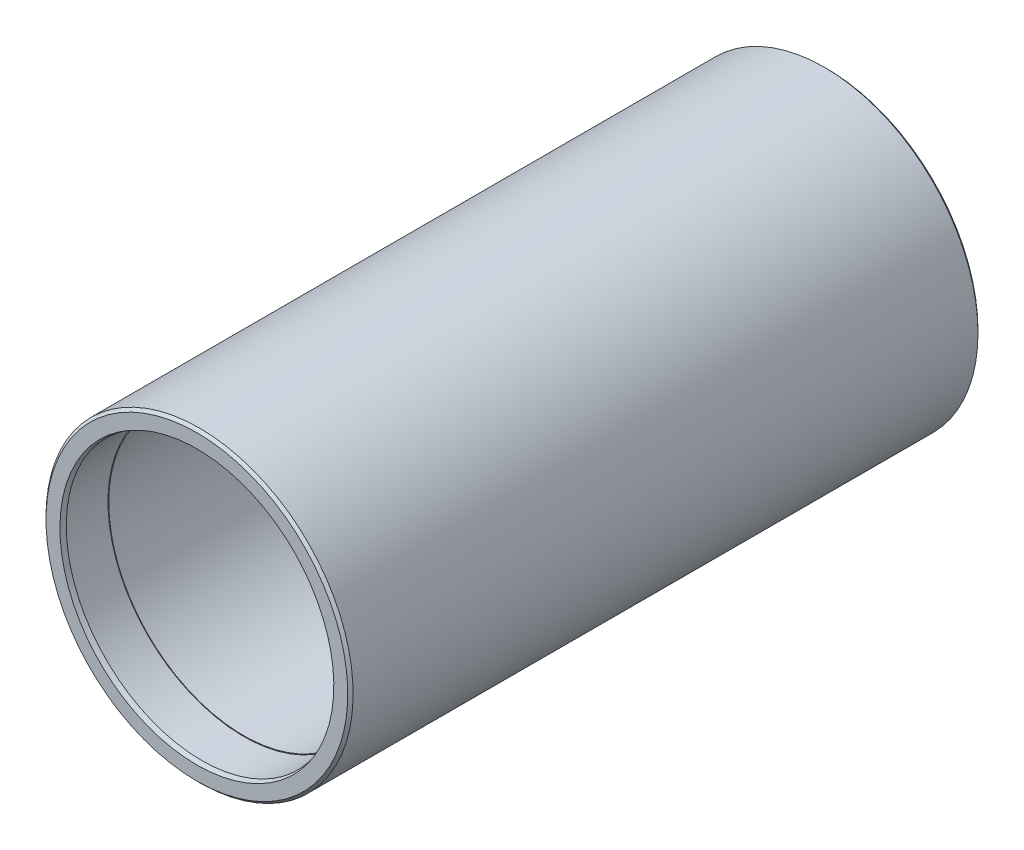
ISO-10303-21;
HEADER;
FILE_DESCRIPTION(('STEP AP214'),'2;1');
FILE_NAME('part.step','',(''),(''),'','','');
FILE_SCHEMA(('AUTOMOTIVE_DESIGN { 1 0 10303 214 1 1 1 1 }'));
ENDSEC;
DATA;
#1=APPLICATION_CONTEXT('core data for automotive mechanical design processes');
#2=APPLICATION_PROTOCOL_DEFINITION('international standard','automotive_design',2000,#1);
#3=PRODUCT_CONTEXT('',#1,'mechanical');
#4=PRODUCT('Part','Part','',(#3));
#5=PRODUCT_RELATED_PRODUCT_CATEGORY('part','',(#4));
#6=PRODUCT_DEFINITION_FORMATION('','',#4);
#7=PRODUCT_DEFINITION_CONTEXT('part definition',#1,'design');
#8=PRODUCT_DEFINITION('design','',#6,#7);
#9=PRODUCT_DEFINITION_SHAPE('','',#8);
#10=(LENGTH_UNIT() NAMED_UNIT(*) SI_UNIT(.MILLI.,.METRE.));
#11=(NAMED_UNIT(*) PLANE_ANGLE_UNIT() SI_UNIT($,.RADIAN.));
#12=(NAMED_UNIT(*) SI_UNIT($,.STERADIAN.) SOLID_ANGLE_UNIT());
#13=UNCERTAINTY_MEASURE_WITH_UNIT(LENGTH_MEASURE(1.E-05),#10,'distance_accuracy_value','');
#14=(GEOMETRIC_REPRESENTATION_CONTEXT(3) GLOBAL_UNCERTAINTY_ASSIGNED_CONTEXT((#13)) GLOBAL_UNIT_ASSIGNED_CONTEXT((#10,
#11,#12)) REPRESENTATION_CONTEXT('',''));
#15=CARTESIAN_POINT('',(0.,0.,0.));
#16=DIRECTION('',(0.,0.,1.));
#17=DIRECTION('',(1.,0.,0.));
#18=AXIS2_PLACEMENT_3D('',#15,#16,#17);
#19=CARTESIAN_POINT('',(0.,0.,3.732050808));
#20=DIRECTION('',(0.,0.,-1.));
#21=DIRECTION('',(0.,1.,0.));
#22=AXIS2_PLACEMENT_3D('',#19,#20,#21);
#23=CONICAL_SURFACE('',#22,101.5,0.26179938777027);
#24=CARTESIAN_POINT('',(0.,0.,0.));
#25=DIRECTION('',(0.,0.,-1.));
#26=DIRECTION('',(0.,1.,0.));
#27=AXIS2_PLACEMENT_3D('',#24,#25,#26);
#28=CIRCLE('',#27,102.5);
#29=CARTESIAN_POINT('',(0.,102.5,0.));
#30=VERTEX_POINT('',#29);
#31=EDGE_CURVE('E18',#30,#30,#28,.T.);
#32=ORIENTED_EDGE('',*,*,#31,.T.);
#33=EDGE_LOOP('',(#32));
#34=FACE_BOUND('',#33,.T.);
#35=CARTESIAN_POINT('',(0.,0.,3.732050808));
#36=DIRECTION('',(0.,0.,-1.));
#37=DIRECTION('',(-1.,0.,0.));
#38=AXIS2_PLACEMENT_3D('',#35,#36,#37);
#39=CIRCLE('',#38,101.5);
#40=CARTESIAN_POINT('',(-101.5,0.,3.732050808));
#41=VERTEX_POINT('',#40);
#42=EDGE_CURVE('E31',#41,#41,#39,.T.);
#43=ORIENTED_EDGE('',*,*,#42,.F.);
#44=EDGE_LOOP('',(#43));
#45=FACE_BOUND('',#44,.T.);
#46=ADVANCED_FACE('F14',(#34,#45),#23,.F.);
#47=CARTESIAN_POINT('',(0.,0.,35.));
#48=DIRECTION('',(0.,0.,-1.));
#49=DIRECTION('',(-1.,0.,0.));
#50=AXIS2_PLACEMENT_3D('',#47,#48,#49);
#51=CYLINDRICAL_SURFACE('',#50,101.5);
#52=ORIENTED_EDGE('',*,*,#42,.T.);
#53=EDGE_LOOP('',(#52));
#54=FACE_BOUND('',#53,.T.);
#55=CARTESIAN_POINT('',(0.,0.,35.));
#56=DIRECTION('',(0.,0.,-1.));
#57=DIRECTION('',(-1.,0.,0.));
#58=AXIS2_PLACEMENT_3D('',#55,#56,#57);
#59=CIRCLE('',#58,101.5);
#60=CARTESIAN_POINT('',(-101.5,0.,35.));
#61=VERTEX_POINT('',#60);
#62=EDGE_CURVE('E48',#61,#61,#59,.T.);
#63=ORIENTED_EDGE('',*,*,#62,.F.);
#64=EDGE_LOOP('',(#63));
#65=FACE_BOUND('',#64,.T.);
#66=ADVANCED_FACE('F58',(#54,#65),#51,.F.);
#67=CARTESIAN_POINT('',(-114.356,-114.356,0.));
#68=DIRECTION('',(0.,0.,1.));
#69=DIRECTION('',(1.,0.,0.));
#70=AXIS2_PLACEMENT_3D('',#67,#68,#69);
#71=PLANE('',#70);
#72=ORIENTED_EDGE('',*,*,#31,.F.);
#73=EDGE_LOOP('',(#72));
#74=FACE_BOUND('',#73,.T.);
#75=CARTESIAN_POINT('',(0.,0.,0.));
#76=DIRECTION('',(0.,0.,1.));
#77=DIRECTION('',(1.,0.,0.));
#78=AXIS2_PLACEMENT_3D('',#75,#76,#77);
#79=CIRCLE('',#78,113.);
#80=CARTESIAN_POINT('',(113.,0.,0.));
#81=VERTEX_POINT('',#80);
#82=EDGE_CURVE('E46',#81,#81,#79,.F.);
#83=ORIENTED_EDGE('',*,*,#82,.T.);
#84=EDGE_LOOP('',(#83));
#85=FACE_BOUND('',#84,.T.);
#86=ADVANCED_FACE('F67',(#74,#85),#71,.F.);
#87=CARTESIAN_POINT('',(102.718,-102.718,35.));
#88=DIRECTION('',(0.,0.,-1.));
#89=DIRECTION('',(-1.,0.,0.));
#90=AXIS2_PLACEMENT_3D('',#87,#88,#89);
#91=PLANE('',#90);
#92=CARTESIAN_POINT('',(0.,0.,35.));
#93=DIRECTION('',(0.,0.,-1.));
#94=DIRECTION('',(-1.,0.,0.));
#95=AXIS2_PLACEMENT_3D('',#92,#93,#94);
#96=CIRCLE('',#95,101.);
#97=CARTESIAN_POINT('',(-101.,0.,35.));
#98=VERTEX_POINT('',#97);
#99=EDGE_CURVE('E43',#98,#98,#96,.T.);
#100=ORIENTED_EDGE('',*,*,#99,.F.);
#101=EDGE_LOOP('',(#100));
#102=FACE_BOUND('',#101,.T.);
#103=ORIENTED_EDGE('',*,*,#62,.T.);
#104=EDGE_LOOP('',(#103));
#105=FACE_BOUND('',#104,.T.);
#106=ADVANCED_FACE('F98',(#102,#105),#91,.T.);
#107=CARTESIAN_POINT('',(0.,0.,0.));
#108=DIRECTION('',(0.,0.,1.));
#109=DIRECTION('',(1.,0.,0.));
#110=AXIS2_PLACEMENT_3D('',#107,#108,#109);
#111=CONICAL_SURFACE('',#110,113.,0.785398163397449);
#112=CARTESIAN_POINT('',(0.,0.,2.));
#113=DIRECTION('',(0.,0.,-1.));
#114=DIRECTION('',(-1.,0.,0.));
#115=AXIS2_PLACEMENT_3D('',#112,#113,#114);
#116=CIRCLE('',#115,115.);
#117=CARTESIAN_POINT('',(-115.,0.,2.));
#118=VERTEX_POINT('',#117);
#119=EDGE_CURVE('E42',#118,#118,#116,.T.);
#120=ORIENTED_EDGE('',*,*,#119,.T.);
#121=EDGE_LOOP('',(#120));
#122=FACE_BOUND('',#121,.T.);
#123=ORIENTED_EDGE('',*,*,#82,.F.);
#124=EDGE_LOOP('',(#123));
#125=FACE_BOUND('',#124,.T.);
#126=ADVANCED_FACE('F95',(#122,#125),#111,.T.);
#127=CARTESIAN_POINT('',(0.,0.,437.));
#128=DIRECTION('',(0.,0.,-1.));
#129=DIRECTION('',(-1.,0.,0.));
#130=AXIS2_PLACEMENT_3D('',#127,#128,#129);
#131=CYLINDRICAL_SURFACE('',#130,101.);
#132=CARTESIAN_POINT('',(0.,0.,437.));
#133=DIRECTION('',(0.,0.,-1.));
#134=DIRECTION('',(-1.,0.,0.));
#135=AXIS2_PLACEMENT_3D('',#132,#133,#134);
#136=CIRCLE('',#135,101.);
#137=CARTESIAN_POINT('',(-101.,0.,437.));
#138=VERTEX_POINT('',#137);
#139=EDGE_CURVE('E39',#138,#138,#136,.T.);
#140=ORIENTED_EDGE('',*,*,#139,.F.);
#141=EDGE_LOOP('',(#140));
#142=FACE_BOUND('',#141,.T.);
#143=ORIENTED_EDGE('',*,*,#99,.T.);
#144=EDGE_LOOP('',(#143));
#145=FACE_BOUND('',#144,.T.);
#146=ADVANCED_FACE('F91',(#142,#145),#131,.F.);
#147=CARTESIAN_POINT('',(0.,0.,470.));
#148=DIRECTION('',(0.,0.,-1.));
#149=DIRECTION('',(-1.,0.,0.));
#150=AXIS2_PLACEMENT_3D('',#147,#148,#149);
#151=CYLINDRICAL_SURFACE('',#150,115.);
#152=ORIENTED_EDGE('',*,*,#119,.F.);
#153=EDGE_LOOP('',(#152));
#154=FACE_BOUND('',#153,.T.);
#155=CARTESIAN_POINT('',(0.,0.,470.));
#156=DIRECTION('',(0.,0.,-1.));
#157=DIRECTION('',(-1.,0.,0.));
#158=AXIS2_PLACEMENT_3D('',#155,#156,#157);
#159=CIRCLE('',#158,115.);
#160=CARTESIAN_POINT('',(-115.,0.,470.));
#161=VERTEX_POINT('',#160);
#162=EDGE_CURVE('E38',#161,#161,#159,.T.);
#163=ORIENTED_EDGE('',*,*,#162,.T.);
#164=EDGE_LOOP('',(#163));
#165=FACE_BOUND('',#164,.T.);
#166=ADVANCED_FACE('F88',(#154,#165),#151,.T.);
#167=CARTESIAN_POINT('',(-102.782262,-102.782262,437.));
#168=DIRECTION('',(0.,0.,1.));
#169=DIRECTION('',(1.,0.,0.));
#170=AXIS2_PLACEMENT_3D('',#167,#168,#169);
#171=PLANE('',#170);
#172=ORIENTED_EDGE('',*,*,#139,.T.);
#173=EDGE_LOOP('',(#172));
#174=FACE_BOUND('',#173,.T.);
#175=CARTESIAN_POINT('',(0.,0.,437.));
#176=DIRECTION('',(0.,0.,1.));
#177=DIRECTION('',(1.,0.,0.));
#178=AXIS2_PLACEMENT_3D('',#175,#176,#177);
#179=CIRCLE('',#178,101.5635);
#180=CARTESIAN_POINT('',(101.5635,0.,437.));
#181=VERTEX_POINT('',#180);
#182=EDGE_CURVE('E35',#181,#181,#179,.F.);
#183=ORIENTED_EDGE('',*,*,#182,.F.);
#184=EDGE_LOOP('',(#183));
#185=FACE_BOUND('',#184,.T.);
#186=ADVANCED_FACE('F86',(#174,#185),#171,.T.);
#187=CARTESIAN_POINT('',(0.,0.,472.));
#188=DIRECTION('',(0.,0.,-1.));
#189=DIRECTION('',(0.,1.,0.));
#190=AXIS2_PLACEMENT_3D('',#187,#188,#189);
#191=CONICAL_SURFACE('',#190,113.,0.785398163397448);
#192=ORIENTED_EDGE('',*,*,#162,.F.);
#193=EDGE_LOOP('',(#192));
#194=FACE_BOUND('',#193,.T.);
#195=CARTESIAN_POINT('',(0.,0.,472.));
#196=DIRECTION('',(0.,0.,-1.));
#197=DIRECTION('',(0.,1.,0.));
#198=AXIS2_PLACEMENT_3D('',#195,#196,#197);
#199=CIRCLE('',#198,113.);
#200=CARTESIAN_POINT('',(0.,113.,472.));
#201=VERTEX_POINT('',#200);
#202=EDGE_CURVE('E27',#201,#201,#199,.F.);
#203=ORIENTED_EDGE('',*,*,#202,.F.);
#204=EDGE_LOOP('',(#203));
#205=FACE_BOUND('',#204,.T.);
#206=ADVANCED_FACE('F82',(#194,#205),#191,.T.);
#207=CARTESIAN_POINT('',(0.,0.,437.));
#208=DIRECTION('',(0.,0.,1.));
#209=DIRECTION('',(1.,0.,0.));
#210=AXIS2_PLACEMENT_3D('',#207,#208,#209);
#211=CYLINDRICAL_SURFACE('',#210,101.5635);
#212=CARTESIAN_POINT('',(0.,0.,468.267949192));
#213=DIRECTION('',(0.,0.,1.));
#214=DIRECTION('',(1.,0.,0.));
#215=AXIS2_PLACEMENT_3D('',#212,#213,#214);
#216=CIRCLE('',#215,101.5635);
#217=CARTESIAN_POINT('',(101.5635,0.,468.267949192));
#218=VERTEX_POINT('',#217);
#219=EDGE_CURVE('E22',#218,#218,#216,.F.);
#220=ORIENTED_EDGE('',*,*,#219,.F.);
#221=EDGE_LOOP('',(#220));
#222=FACE_BOUND('',#221,.T.);
#223=ORIENTED_EDGE('',*,*,#182,.T.);
#224=EDGE_LOOP('',(#223));
#225=FACE_BOUND('',#224,.T.);
#226=ADVANCED_FACE('F76',(#222,#225),#211,.F.);
#227=CARTESIAN_POINT('',(-114.356,-114.356,472.));
#228=DIRECTION('',(0.,0.,1.));
#229=DIRECTION('',(1.,0.,0.));
#230=AXIS2_PLACEMENT_3D('',#227,#228,#229);
#231=PLANE('',#230);
#232=CARTESIAN_POINT('',(0.,0.,472.));
#233=DIRECTION('',(0.,0.,1.));
#234=DIRECTION('',(0.,-1.,0.));
#235=AXIS2_PLACEMENT_3D('',#232,#233,#234);
#236=CIRCLE('',#235,102.5635);
#237=CARTESIAN_POINT('',(0.,-102.5635,472.));
#238=VERTEX_POINT('',#237);
#239=EDGE_CURVE('E10',#238,#238,#236,.T.);
#240=ORIENTED_EDGE('',*,*,#239,.F.);
#241=EDGE_LOOP('',(#240));
#242=FACE_BOUND('',#241,.T.);
#243=ORIENTED_EDGE('',*,*,#202,.T.);
#244=EDGE_LOOP('',(#243));
#245=FACE_BOUND('',#244,.T.);
#246=ADVANCED_FACE('F16',(#242,#245),#231,.T.);
#247=CARTESIAN_POINT('',(0.,0.,468.267949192));
#248=DIRECTION('',(0.,0.,1.));
#249=DIRECTION('',(0.,-1.,0.));
#250=AXIS2_PLACEMENT_3D('',#247,#248,#249);
#251=CONICAL_SURFACE('',#250,101.5635,0.261799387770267);
#252=ORIENTED_EDGE('',*,*,#239,.T.);
#253=EDGE_LOOP('',(#252));
#254=FACE_BOUND('',#253,.T.);
#255=ORIENTED_EDGE('',*,*,#219,.T.);
#256=EDGE_LOOP('',(#255));
#257=FACE_BOUND('',#256,.T.);
#258=ADVANCED_FACE('F70',(#254,#257),#251,.F.);
#259=CLOSED_SHELL('',(#46,#66,#86,#106,#126,#146,#166,#186,#206,#226,#246,#258));
#260=MANIFOLD_SOLID_BREP('B1',#259);
#261=ADVANCED_BREP_SHAPE_REPRESENTATION('',(#18,#260),#14);
#262=SHAPE_DEFINITION_REPRESENTATION(#9,#261);
ENDSEC;
END-ISO-10303-21;
